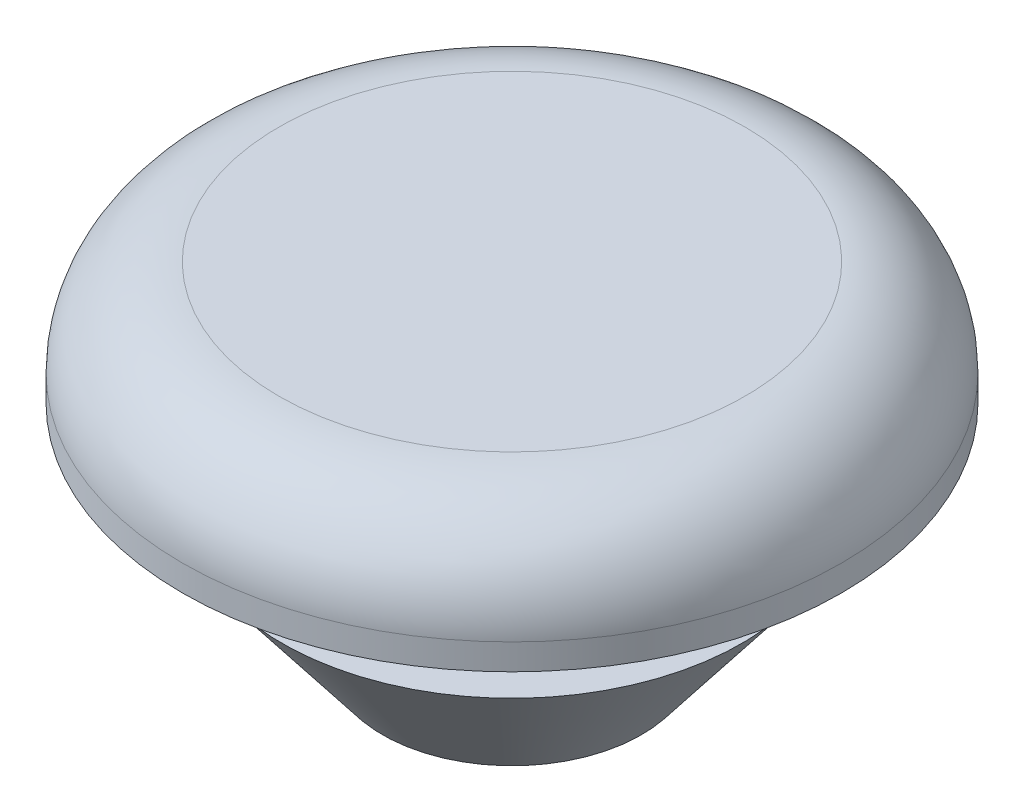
ISO-10303-21;
HEADER;
FILE_DESCRIPTION(('STEP AP214'),'2;1');
FILE_NAME('part.step','',(''),(''),'','','');
FILE_SCHEMA(('AUTOMOTIVE_DESIGN { 1 0 10303 214 1 1 1 1 }'));
ENDSEC;
DATA;
#1=APPLICATION_CONTEXT('core data for automotive mechanical design processes');
#2=APPLICATION_PROTOCOL_DEFINITION('international standard','automotive_design',2000,#1);
#3=PRODUCT_CONTEXT('',#1,'mechanical');
#4=PRODUCT('Part','Part','',(#3));
#5=PRODUCT_RELATED_PRODUCT_CATEGORY('part','',(#4));
#6=PRODUCT_DEFINITION_FORMATION('','',#4);
#7=PRODUCT_DEFINITION_CONTEXT('part definition',#1,'design');
#8=PRODUCT_DEFINITION('design','',#6,#7);
#9=PRODUCT_DEFINITION_SHAPE('','',#8);
#10=(LENGTH_UNIT() NAMED_UNIT(*) SI_UNIT(.MILLI.,.METRE.));
#11=(NAMED_UNIT(*) PLANE_ANGLE_UNIT() SI_UNIT($,.RADIAN.));
#12=(NAMED_UNIT(*) SI_UNIT($,.STERADIAN.) SOLID_ANGLE_UNIT());
#13=UNCERTAINTY_MEASURE_WITH_UNIT(LENGTH_MEASURE(1.E-05),#10,'distance_accuracy_value','');
#14=(GEOMETRIC_REPRESENTATION_CONTEXT(3) GLOBAL_UNCERTAINTY_ASSIGNED_CONTEXT((#13)) GLOBAL_UNIT_ASSIGNED_CONTEXT((#10,
#11,#12)) REPRESENTATION_CONTEXT('',''));
#15=CARTESIAN_POINT('',(0.,0.,0.));
#16=DIRECTION('',(0.,0.,1.));
#17=DIRECTION('',(1.,0.,0.));
#18=AXIS2_PLACEMENT_3D('',#15,#16,#17);
#19=CARTESIAN_POINT('',(0.,8.4582,0.));
#20=DIRECTION('',(0.,1.,0.));
#21=DIRECTION('',(0.,0.,1.));
#22=AXIS2_PLACEMENT_3D('',#19,#20,#21);
#23=PLANE('',#22);
#24=CARTESIAN_POINT('',(0.,8.4582,0.));
#25=DIRECTION('',(0.,-1.,0.));
#26=DIRECTION('',(0.,0.,-1.));
#27=AXIS2_PLACEMENT_3D('',#24,#25,#26);
#28=CIRCLE('',#27,5.715);
#29=CARTESIAN_POINT('',(0.,8.4582,-5.715));
#30=VERTEX_POINT('',#29);
#31=EDGE_CURVE('E10',#30,#30,#28,.T.);
#32=ORIENTED_EDGE('',*,*,#31,.F.);
#33=EDGE_LOOP('',(#32));
#34=FACE_BOUND('',#33,.T.);
#35=ADVANCED_FACE('F33',(#34),#23,.T.);
#36=CARTESIAN_POINT('',(0.,6.096,0.));
#37=DIRECTION('',(0.,-1.,0.));
#38=DIRECTION('',(0.,0.,-1.));
#39=AXIS2_PLACEMENT_3D('',#36,#37,#38);
#40=TOROIDAL_SURFACE('',#39,5.715,2.3622);
#41=ORIENTED_EDGE('',*,*,#31,.T.);
#42=EDGE_LOOP('',(#41));
#43=FACE_BOUND('',#42,.T.);
#44=CARTESIAN_POINT('',(0.,6.096,0.));
#45=DIRECTION('',(0.,-1.,0.));
#46=DIRECTION('',(0.,0.,-1.));
#47=AXIS2_PLACEMENT_3D('',#44,#45,#46);
#48=CIRCLE('',#47,8.0772);
#49=CARTESIAN_POINT('',(0.,6.096,-8.0772));
#50=VERTEX_POINT('',#49);
#51=EDGE_CURVE('E39',#50,#50,#48,.T.);
#52=ORIENTED_EDGE('',*,*,#51,.F.);
#53=EDGE_LOOP('',(#52));
#54=FACE_BOUND('',#53,.T.);
#55=ADVANCED_FACE('F78',(#43,#54),#40,.T.);
#56=CARTESIAN_POINT('',(0.,0.,0.));
#57=DIRECTION('',(0.,-1.,0.));
#58=DIRECTION('',(0.,0.,-1.));
#59=AXIS2_PLACEMENT_3D('',#56,#57,#58);
#60=CYLINDRICAL_SURFACE('',#59,8.0772);
#61=ORIENTED_EDGE('',*,*,#51,.T.);
#62=EDGE_LOOP('',(#61));
#63=FACE_BOUND('',#62,.T.);
#64=CARTESIAN_POINT('',(0.,5.461,0.));
#65=DIRECTION('',(0.,-1.,0.));
#66=DIRECTION('',(0.,0.,-1.));
#67=AXIS2_PLACEMENT_3D('',#64,#65,#66);
#68=CIRCLE('',#67,8.0772);
#69=CARTESIAN_POINT('',(0.,5.461,-8.0772));
#70=VERTEX_POINT('',#69);
#71=EDGE_CURVE('E43',#70,#70,#68,.T.);
#72=ORIENTED_EDGE('',*,*,#71,.F.);
#73=EDGE_LOOP('',(#72));
#74=FACE_BOUND('',#73,.T.);
#75=ADVANCED_FACE('F83',(#63,#74),#60,.T.);
#76=CARTESIAN_POINT('',(0.,5.461,-3.7592));
#77=DIRECTION('',(0.,-1.,0.));
#78=DIRECTION('',(0.,0.,-1.));
#79=AXIS2_PLACEMENT_3D('',#76,#77,#78);
#80=PLANE('',#79);
#81=ORIENTED_EDGE('',*,*,#71,.T.);
#82=EDGE_LOOP('',(#81));
#83=FACE_BOUND('',#82,.T.);
#84=CARTESIAN_POINT('',(0.,5.461,0.));
#85=DIRECTION('',(0.,-1.,0.));
#86=DIRECTION('',(0.,0.,-1.));
#87=AXIS2_PLACEMENT_3D('',#84,#85,#86);
#88=CIRCLE('',#87,3.7592);
#89=CARTESIAN_POINT('',(0.,5.461,-3.7592));
#90=VERTEX_POINT('',#89);
#91=EDGE_CURVE('E47',#90,#90,#88,.T.);
#92=ORIENTED_EDGE('',*,*,#91,.F.);
#93=EDGE_LOOP('',(#92));
#94=FACE_BOUND('',#93,.T.);
#95=ADVANCED_FACE('F87',(#83,#94),#80,.T.);
#96=CARTESIAN_POINT('',(0.,0.,0.));
#97=DIRECTION('',(0.,-1.,0.));
#98=DIRECTION('',(0.,0.,-1.));
#99=AXIS2_PLACEMENT_3D('',#96,#97,#98);
#100=CYLINDRICAL_SURFACE('',#99,3.7592);
#101=ORIENTED_EDGE('',*,*,#91,.T.);
#102=EDGE_LOOP('',(#101));
#103=FACE_BOUND('',#102,.T.);
#104=CARTESIAN_POINT('',(0.,3.175,0.));
#105=DIRECTION('',(0.,-1.,0.));
#106=DIRECTION('',(0.,0.,-1.));
#107=AXIS2_PLACEMENT_3D('',#104,#105,#106);
#108=CIRCLE('',#107,3.7592);
#109=CARTESIAN_POINT('',(0.,3.175,-3.7592));
#110=VERTEX_POINT('',#109);
#111=EDGE_CURVE('E52',#110,#110,#108,.T.);
#112=ORIENTED_EDGE('',*,*,#111,.F.);
#113=EDGE_LOOP('',(#112));
#114=FACE_BOUND('',#113,.T.);
#115=ADVANCED_FACE('F74',(#103,#114),#100,.T.);
#116=CARTESIAN_POINT('',(0.,3.175,-5.6388));
#117=DIRECTION('',(0.,1.,0.));
#118=DIRECTION('',(0.,0.,1.));
#119=AXIS2_PLACEMENT_3D('',#116,#117,#118);
#120=PLANE('',#119);
#121=ORIENTED_EDGE('',*,*,#111,.T.);
#122=EDGE_LOOP('',(#121));
#123=FACE_BOUND('',#122,.T.);
#124=CARTESIAN_POINT('',(0.,3.175,0.));
#125=DIRECTION('',(0.,-1.,0.));
#126=DIRECTION('',(0.,0.,-1.));
#127=AXIS2_PLACEMENT_3D('',#124,#125,#126);
#128=CIRCLE('',#127,5.6388);
#129=CARTESIAN_POINT('',(0.,3.175,-5.6388));
#130=VERTEX_POINT('',#129);
#131=EDGE_CURVE('E55',#130,#130,#128,.T.);
#132=ORIENTED_EDGE('',*,*,#131,.F.);
#133=EDGE_LOOP('',(#132));
#134=FACE_BOUND('',#133,.T.);
#135=ADVANCED_FACE('F66',(#123,#134),#120,.T.);
#136=CARTESIAN_POINT('',(0.,0.,0.));
#137=DIRECTION('',(0.,1.,0.));
#138=DIRECTION('',(0.,0.,1.));
#139=AXIS2_PLACEMENT_3D('',#136,#137,#138);
#140=CONICAL_SURFACE('',#139,3.175,0.659934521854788);
#141=ORIENTED_EDGE('',*,*,#131,.T.);
#142=EDGE_LOOP('',(#141));
#143=FACE_BOUND('',#142,.T.);
#144=CARTESIAN_POINT('',(0.,0.,0.));
#145=DIRECTION('',(0.,-1.,0.));
#146=DIRECTION('',(0.,0.,-1.));
#147=AXIS2_PLACEMENT_3D('',#144,#145,#146);
#148=CIRCLE('',#147,3.175);
#149=CARTESIAN_POINT('',(0.,0.,-3.175));
#150=VERTEX_POINT('',#149);
#151=EDGE_CURVE('E58',#150,#150,#148,.T.);
#152=ORIENTED_EDGE('',*,*,#151,.F.);
#153=EDGE_LOOP('',(#152));
#154=FACE_BOUND('',#153,.T.);
#155=ADVANCED_FACE('F64',(#143,#154),#140,.T.);
#156=CARTESIAN_POINT('',(0.,0.,0.));
#157=DIRECTION('',(0.,-1.,0.));
#158=DIRECTION('',(0.,0.,-1.));
#159=AXIS2_PLACEMENT_3D('',#156,#157,#158);
#160=PLANE('',#159);
#161=ORIENTED_EDGE('',*,*,#151,.T.);
#162=EDGE_LOOP('',(#161));
#163=FACE_BOUND('',#162,.T.);
#164=ADVANCED_FACE('F62',(#163),#160,.T.);
#165=CLOSED_SHELL('',(#35,#55,#75,#95,#115,#135,#155,#164));
#166=MANIFOLD_SOLID_BREP('B2',#165);
#167=ADVANCED_BREP_SHAPE_REPRESENTATION('',(#18,#166),#14);
#168=SHAPE_DEFINITION_REPRESENTATION(#9,#167);
ENDSEC;
END-ISO-10303-21;
